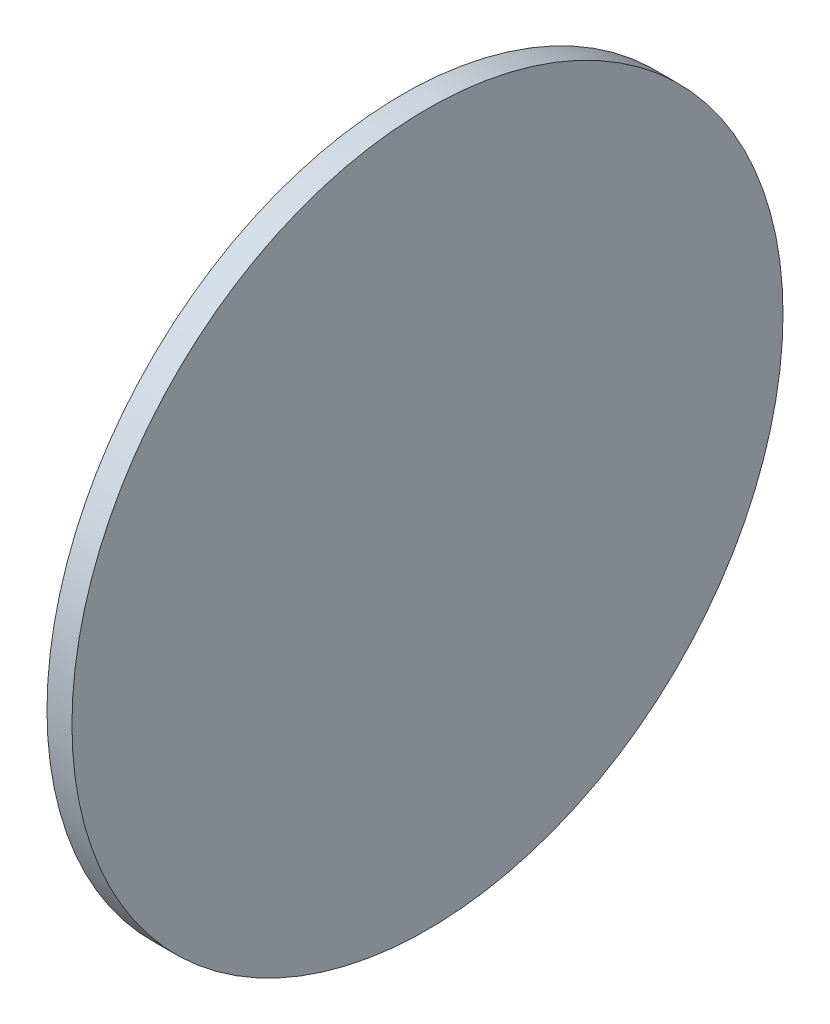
from build123d import *

# Parameters (mm, degrees)
SKETCH1_R           = 71.25
BOSS_EXTRUDE1_DEPTH = 5


with BuildPart() as part:
    # Sketch1 → Boss-Extrude1 (new body)
    with BuildSketch(Plane(origin=(0, 0, 0), x_dir=(0, 0, -1), z_dir=(1, 0, 0))):
        Circle(SKETCH1_R)
    extrude(amount=BOSS_EXTRUDE1_DEPTH)


solid = part.part
